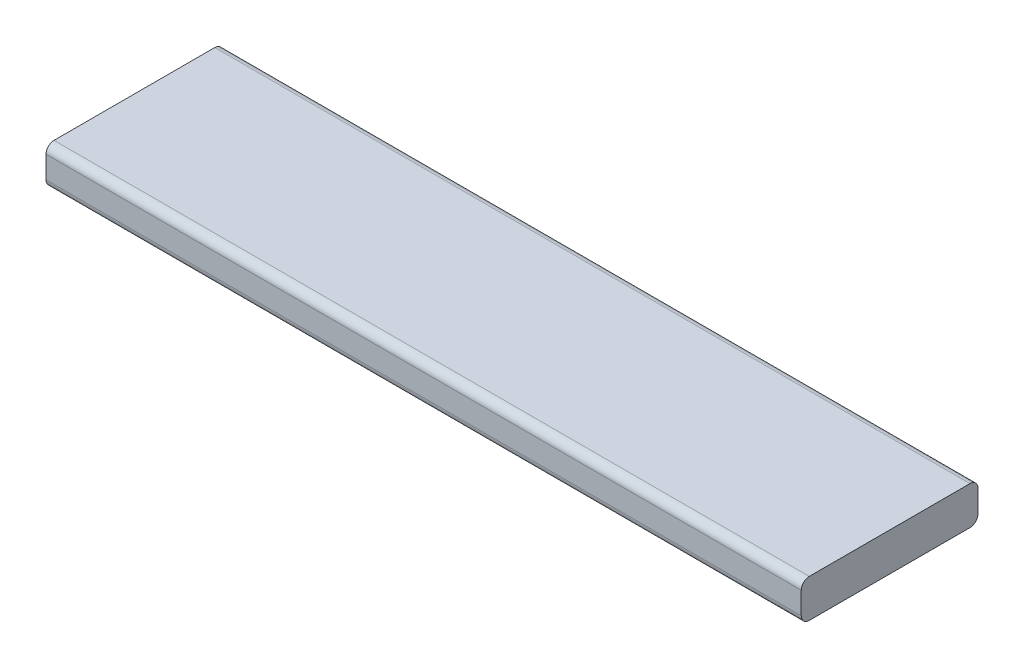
ISO-10303-21;
HEADER;
FILE_DESCRIPTION(('STEP AP214'),'2;1');
FILE_NAME('part.step','',(''),(''),'','','');
FILE_SCHEMA(('AUTOMOTIVE_DESIGN { 1 0 10303 214 1 1 1 1 }'));
ENDSEC;
DATA;
#1=APPLICATION_CONTEXT('core data for automotive mechanical design processes');
#2=APPLICATION_PROTOCOL_DEFINITION('international standard','automotive_design',2000,#1);
#3=PRODUCT_CONTEXT('',#1,'mechanical');
#4=PRODUCT('Part','Part','',(#3));
#5=PRODUCT_RELATED_PRODUCT_CATEGORY('part','',(#4));
#6=PRODUCT_DEFINITION_FORMATION('','',#4);
#7=PRODUCT_DEFINITION_CONTEXT('part definition',#1,'design');
#8=PRODUCT_DEFINITION('design','',#6,#7);
#9=PRODUCT_DEFINITION_SHAPE('','',#8);
#10=(LENGTH_UNIT() NAMED_UNIT(*) SI_UNIT(.MILLI.,.METRE.));
#11=(NAMED_UNIT(*) PLANE_ANGLE_UNIT() SI_UNIT($,.RADIAN.));
#12=(NAMED_UNIT(*) SI_UNIT($,.STERADIAN.) SOLID_ANGLE_UNIT());
#13=UNCERTAINTY_MEASURE_WITH_UNIT(LENGTH_MEASURE(1.E-05),#10,'distance_accuracy_value','');
#14=(GEOMETRIC_REPRESENTATION_CONTEXT(3) GLOBAL_UNCERTAINTY_ASSIGNED_CONTEXT((#13)) GLOBAL_UNIT_ASSIGNED_CONTEXT((#10,
#11,#12)) REPRESENTATION_CONTEXT('',''));
#15=CARTESIAN_POINT('',(0.,0.,0.));
#16=DIRECTION('',(0.,0.,1.));
#17=DIRECTION('',(1.,0.,0.));
#18=AXIS2_PLACEMENT_3D('',#15,#16,#17);
#19=CARTESIAN_POINT('',(739.819090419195,0.,0.));
#20=DIRECTION('',(0.,0.,1.));
#21=DIRECTION('',(1.,0.,0.));
#22=AXIS2_PLACEMENT_3D('',#19,#20,#21);
#23=PLANE('',#22);
#24=DIRECTION('',(0.,1.,0.));
#25=VECTOR('',#24,1.);
#26=CARTESIAN_POINT('',(0.,0.,0.));
#27=LINE('',#26,#25);
#28=CARTESIAN_POINT('',(0.,6.35,0.));
#29=VERTEX_POINT('',#28);
#30=CARTESIAN_POINT('',(0.,23.8125,0.));
#31=VERTEX_POINT('',#30);
#32=EDGE_CURVE('E175',#29,#31,#27,.T.);
#33=ORIENTED_EDGE('',*,*,#32,.T.);
#34=DIRECTION('',(-1.,0.,0.));
#35=VECTOR('',#34,1.);
#36=CARTESIAN_POINT('',(739.819090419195,23.8125,0.));
#37=LINE('',#36,#35);
#38=CARTESIAN_POINT('',(596.9,23.8125,0.));
#39=VERTEX_POINT('',#38);
#40=EDGE_CURVE('E56',#31,#39,#37,.F.);
#41=ORIENTED_EDGE('',*,*,#40,.T.);
#42=DIRECTION('',(0.,1.,0.));
#43=VECTOR('',#42,1.);
#44=CARTESIAN_POINT('',(596.9,0.,0.));
#45=LINE('',#44,#43);
#46=CARTESIAN_POINT('',(596.9,6.35,0.));
#47=VERTEX_POINT('',#46);
#48=EDGE_CURVE('E169',#47,#39,#45,.T.);
#49=ORIENTED_EDGE('',*,*,#48,.F.);
#50=DIRECTION('',(-1.,0.,0.));
#51=VECTOR('',#50,1.);
#52=CARTESIAN_POINT('',(739.819090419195,6.35,0.));
#53=LINE('',#52,#51);
#54=EDGE_CURVE('E117',#47,#29,#53,.T.);
#55=ORIENTED_EDGE('',*,*,#54,.T.);
#56=EDGE_LOOP('',(#33,#41,#49,#55));
#57=FACE_BOUND('',#56,.T.);
#58=ADVANCED_FACE('F41',(#57),#23,.F.);
#59=CARTESIAN_POINT('',(739.819090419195,30.1625,0.));
#60=DIRECTION('',(0.,-1.,0.));
#61=DIRECTION('',(0.,0.,-1.));
#62=AXIS2_PLACEMENT_3D('',#59,#60,#61);
#63=PLANE('',#62);
#64=DIRECTION('',(0.,0.,1.));
#65=VECTOR('',#64,1.);
#66=CARTESIAN_POINT('',(0.,30.1625,0.));
#67=LINE('',#66,#65);
#68=CARTESIAN_POINT('',(0.,30.1625,6.35));
#69=VERTEX_POINT('',#68);
#70=CARTESIAN_POINT('',(0.,30.1625,133.35));
#71=VERTEX_POINT('',#70);
#72=EDGE_CURVE('E170',#69,#71,#67,.T.);
#73=ORIENTED_EDGE('',*,*,#72,.T.);
#74=DIRECTION('',(-1.,0.,0.));
#75=VECTOR('',#74,1.);
#76=CARTESIAN_POINT('',(739.819090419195,30.1625,133.35));
#77=LINE('',#76,#75);
#78=CARTESIAN_POINT('',(596.9,30.1625,133.35));
#79=VERTEX_POINT('',#78);
#80=EDGE_CURVE('E145',#71,#79,#77,.F.);
#81=ORIENTED_EDGE('',*,*,#80,.T.);
#82=DIRECTION('',(0.,0.,1.));
#83=VECTOR('',#82,1.);
#84=CARTESIAN_POINT('',(596.9,30.1625,0.));
#85=LINE('',#84,#83);
#86=CARTESIAN_POINT('',(596.9,30.1625,6.35));
#87=VERTEX_POINT('',#86);
#88=EDGE_CURVE('E113',#87,#79,#85,.T.);
#89=ORIENTED_EDGE('',*,*,#88,.F.);
#90=DIRECTION('',(-1.,0.,0.));
#91=VECTOR('',#90,1.);
#92=CARTESIAN_POINT('',(739.819090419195,30.1625,6.35));
#93=LINE('',#92,#91);
#94=EDGE_CURVE('E142',#87,#69,#93,.T.);
#95=ORIENTED_EDGE('',*,*,#94,.T.);
#96=EDGE_LOOP('',(#73,#81,#89,#95));
#97=FACE_BOUND('',#96,.T.);
#98=ADVANCED_FACE('F185',(#97),#63,.F.);
#99=CARTESIAN_POINT('',(739.819090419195,0.,139.7));
#100=DIRECTION('',(0.,0.,-1.));
#101=DIRECTION('',(-1.,0.,0.));
#102=AXIS2_PLACEMENT_3D('',#99,#100,#101);
#103=PLANE('',#102);
#104=DIRECTION('',(0.,-1.,0.));
#105=VECTOR('',#104,1.);
#106=CARTESIAN_POINT('',(596.9,0.,139.7));
#107=LINE('',#106,#105);
#108=CARTESIAN_POINT('',(596.9,23.8125,139.7));
#109=VERTEX_POINT('',#108);
#110=CARTESIAN_POINT('',(596.9,6.34999999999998,139.7));
#111=VERTEX_POINT('',#110);
#112=EDGE_CURVE('E110',#109,#111,#107,.T.);
#113=ORIENTED_EDGE('',*,*,#112,.F.);
#114=DIRECTION('',(-1.,0.,0.));
#115=VECTOR('',#114,1.);
#116=CARTESIAN_POINT('',(739.819090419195,23.8125,139.7));
#117=LINE('',#116,#115);
#118=CARTESIAN_POINT('',(0.,23.8125,139.7));
#119=VERTEX_POINT('',#118);
#120=EDGE_CURVE('E124',#109,#119,#117,.T.);
#121=ORIENTED_EDGE('',*,*,#120,.T.);
#122=DIRECTION('',(0.,-1.,0.));
#123=VECTOR('',#122,1.);
#124=CARTESIAN_POINT('',(0.,0.,139.7));
#125=LINE('',#124,#123);
#126=CARTESIAN_POINT('',(0.,6.34999999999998,139.7));
#127=VERTEX_POINT('',#126);
#128=EDGE_CURVE('E167',#119,#127,#125,.T.);
#129=ORIENTED_EDGE('',*,*,#128,.T.);
#130=DIRECTION('',(-1.,0.,0.));
#131=VECTOR('',#130,1.);
#132=CARTESIAN_POINT('',(739.819090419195,6.34999999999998,139.7));
#133=LINE('',#132,#131);
#134=EDGE_CURVE('E127',#127,#111,#133,.F.);
#135=ORIENTED_EDGE('',*,*,#134,.T.);
#136=EDGE_LOOP('',(#113,#121,#129,#135));
#137=FACE_BOUND('',#136,.T.);
#138=ADVANCED_FACE('F122',(#137),#103,.F.);
#139=CARTESIAN_POINT('',(739.819090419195,0.,0.));
#140=DIRECTION('',(0.,1.,0.));
#141=DIRECTION('',(0.,0.,1.));
#142=AXIS2_PLACEMENT_3D('',#139,#140,#141);
#143=PLANE('',#142);
#144=DIRECTION('',(0.,0.,-1.));
#145=VECTOR('',#144,1.);
#146=CARTESIAN_POINT('',(0.,0.,0.));
#147=LINE('',#146,#145);
#148=CARTESIAN_POINT('',(0.,0.,133.35));
#149=VERTEX_POINT('',#148);
#150=CARTESIAN_POINT('',(0.,0.,6.35));
#151=VERTEX_POINT('',#150);
#152=EDGE_CURVE('E160',#149,#151,#147,.T.);
#153=ORIENTED_EDGE('',*,*,#152,.T.);
#154=DIRECTION('',(-1.,0.,0.));
#155=VECTOR('',#154,1.);
#156=CARTESIAN_POINT('',(739.819090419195,0.,6.35));
#157=LINE('',#156,#155);
#158=CARTESIAN_POINT('',(596.9,0.,6.35));
#159=VERTEX_POINT('',#158);
#160=EDGE_CURVE('E11',#151,#159,#157,.F.);
#161=ORIENTED_EDGE('',*,*,#160,.T.);
#162=DIRECTION('',(0.,0.,-1.));
#163=VECTOR('',#162,1.);
#164=CARTESIAN_POINT('',(596.9,0.,0.));
#165=LINE('',#164,#163);
#166=CARTESIAN_POINT('',(596.9,0.,133.35));
#167=VERTEX_POINT('',#166);
#168=EDGE_CURVE('E162',#167,#159,#165,.T.);
#169=ORIENTED_EDGE('',*,*,#168,.F.);
#170=DIRECTION('',(-1.,0.,0.));
#171=VECTOR('',#170,1.);
#172=CARTESIAN_POINT('',(739.819090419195,0.,133.35));
#173=LINE('',#172,#171);
#174=EDGE_CURVE('E49',#167,#149,#173,.T.);
#175=ORIENTED_EDGE('',*,*,#174,.T.);
#176=EDGE_LOOP('',(#153,#161,#169,#175));
#177=FACE_BOUND('',#176,.T.);
#178=ADVANCED_FACE('F159',(#177),#143,.F.);
#179=CARTESIAN_POINT('',(0.,0.,0.));
#180=DIRECTION('',(1.,0.,0.));
#181=DIRECTION('',(0.,0.,-1.));
#182=AXIS2_PLACEMENT_3D('',#179,#180,#181);
#183=PLANE('',#182);
#184=ORIENTED_EDGE('',*,*,#128,.F.);
#185=CARTESIAN_POINT('',(0.,23.8125,133.35));
#186=DIRECTION('',(1.,0.,0.));
#187=DIRECTION('',(0.,0.,-1.));
#188=AXIS2_PLACEMENT_3D('',#185,#186,#187);
#189=CIRCLE('',#188,6.35);
#190=EDGE_CURVE('E130',#119,#71,#189,.F.);
#191=ORIENTED_EDGE('',*,*,#190,.T.);
#192=ORIENTED_EDGE('',*,*,#72,.F.);
#193=CARTESIAN_POINT('',(0.,23.8125,6.35));
#194=DIRECTION('',(1.,0.,0.));
#195=DIRECTION('',(0.,0.,-1.));
#196=AXIS2_PLACEMENT_3D('',#193,#194,#195);
#197=CIRCLE('',#196,6.35);
#198=EDGE_CURVE('E139',#69,#31,#197,.F.);
#199=ORIENTED_EDGE('',*,*,#198,.T.);
#200=ORIENTED_EDGE('',*,*,#32,.F.);
#201=CARTESIAN_POINT('',(0.,6.35,6.35));
#202=DIRECTION('',(1.,0.,0.));
#203=DIRECTION('',(0.,0.,-1.));
#204=AXIS2_PLACEMENT_3D('',#201,#202,#203);
#205=CIRCLE('',#204,6.35);
#206=EDGE_CURVE('E133',#29,#151,#205,.F.);
#207=ORIENTED_EDGE('',*,*,#206,.T.);
#208=ORIENTED_EDGE('',*,*,#152,.F.);
#209=CARTESIAN_POINT('',(0.,6.34999999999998,133.35));
#210=DIRECTION('',(1.,0.,0.));
#211=DIRECTION('',(0.,0.,-1.));
#212=AXIS2_PLACEMENT_3D('',#209,#210,#211);
#213=CIRCLE('',#212,6.35);
#214=EDGE_CURVE('E131',#149,#127,#213,.F.);
#215=ORIENTED_EDGE('',*,*,#214,.T.);
#216=EDGE_LOOP('',(#184,#191,#192,#199,#200,#207,#208,#215));
#217=FACE_BOUND('',#216,.T.);
#218=ADVANCED_FACE('F165',(#217),#183,.F.);
#219=CARTESIAN_POINT('',(596.9,0.,0.));
#220=DIRECTION('',(1.,0.,0.));
#221=DIRECTION('',(0.,0.,-1.));
#222=AXIS2_PLACEMENT_3D('',#219,#220,#221);
#223=PLANE('',#222);
#224=ORIENTED_EDGE('',*,*,#88,.T.);
#225=CARTESIAN_POINT('',(596.9,23.8125,133.35));
#226=DIRECTION('',(1.,0.,0.));
#227=DIRECTION('',(0.,0.,-1.));
#228=AXIS2_PLACEMENT_3D('',#225,#226,#227);
#229=CIRCLE('',#228,6.35);
#230=EDGE_CURVE('E107',#79,#109,#229,.T.);
#231=ORIENTED_EDGE('',*,*,#230,.T.);
#232=ORIENTED_EDGE('',*,*,#112,.T.);
#233=CARTESIAN_POINT('',(596.9,6.34999999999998,133.35));
#234=DIRECTION('',(1.,0.,0.));
#235=DIRECTION('',(0.,0.,-1.));
#236=AXIS2_PLACEMENT_3D('',#233,#234,#235);
#237=CIRCLE('',#236,6.35);
#238=EDGE_CURVE('E147',#111,#167,#237,.T.);
#239=ORIENTED_EDGE('',*,*,#238,.T.);
#240=ORIENTED_EDGE('',*,*,#168,.T.);
#241=CARTESIAN_POINT('',(596.9,6.35,6.35));
#242=DIRECTION('',(1.,0.,0.));
#243=DIRECTION('',(0.,0.,-1.));
#244=AXIS2_PLACEMENT_3D('',#241,#242,#243);
#245=CIRCLE('',#244,6.35);
#246=EDGE_CURVE('E63',#159,#47,#245,.T.);
#247=ORIENTED_EDGE('',*,*,#246,.T.);
#248=ORIENTED_EDGE('',*,*,#48,.T.);
#249=CARTESIAN_POINT('',(596.9,23.8125,6.35));
#250=DIRECTION('',(1.,0.,0.));
#251=DIRECTION('',(0.,0.,-1.));
#252=AXIS2_PLACEMENT_3D('',#249,#250,#251);
#253=CIRCLE('',#252,6.35);
#254=EDGE_CURVE('E118',#39,#87,#253,.T.);
#255=ORIENTED_EDGE('',*,*,#254,.T.);
#256=EDGE_LOOP('',(#224,#231,#232,#239,#240,#247,#248,#255));
#257=FACE_BOUND('',#256,.T.);
#258=ADVANCED_FACE('F109',(#257),#223,.T.);
#259=CARTESIAN_POINT('',(739.819090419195,23.8125,133.35));
#260=DIRECTION('',(-1.,0.,0.));
#261=DIRECTION('',(0.,0.,1.));
#262=AXIS2_PLACEMENT_3D('',#259,#260,#261);
#263=CYLINDRICAL_SURFACE('',#262,6.35);
#264=ORIENTED_EDGE('',*,*,#230,.F.);
#265=ORIENTED_EDGE('',*,*,#80,.F.);
#266=ORIENTED_EDGE('',*,*,#190,.F.);
#267=ORIENTED_EDGE('',*,*,#120,.F.);
#268=EDGE_LOOP('',(#264,#265,#266,#267));
#269=FACE_BOUND('',#268,.T.);
#270=ADVANCED_FACE('F129',(#269),#263,.T.);
#271=CARTESIAN_POINT('',(739.819090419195,23.8125,6.35));
#272=DIRECTION('',(-1.,0.,0.));
#273=DIRECTION('',(0.,0.,1.));
#274=AXIS2_PLACEMENT_3D('',#271,#272,#273);
#275=CYLINDRICAL_SURFACE('',#274,6.35);
#276=ORIENTED_EDGE('',*,*,#254,.F.);
#277=ORIENTED_EDGE('',*,*,#40,.F.);
#278=ORIENTED_EDGE('',*,*,#198,.F.);
#279=ORIENTED_EDGE('',*,*,#94,.F.);
#280=EDGE_LOOP('',(#276,#277,#278,#279));
#281=FACE_BOUND('',#280,.T.);
#282=ADVANCED_FACE('F182',(#281),#275,.T.);
#283=CARTESIAN_POINT('',(739.819090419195,6.35,6.35));
#284=DIRECTION('',(-1.,0.,0.));
#285=DIRECTION('',(0.,0.,1.));
#286=AXIS2_PLACEMENT_3D('',#283,#284,#285);
#287=CYLINDRICAL_SURFACE('',#286,6.35);
#288=ORIENTED_EDGE('',*,*,#246,.F.);
#289=ORIENTED_EDGE('',*,*,#160,.F.);
#290=ORIENTED_EDGE('',*,*,#206,.F.);
#291=ORIENTED_EDGE('',*,*,#54,.F.);
#292=EDGE_LOOP('',(#288,#289,#290,#291));
#293=FACE_BOUND('',#292,.T.);
#294=ADVANCED_FACE('F187',(#293),#287,.T.);
#295=CARTESIAN_POINT('',(739.819090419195,6.34999999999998,133.35));
#296=DIRECTION('',(-1.,0.,0.));
#297=DIRECTION('',(0.,0.,1.));
#298=AXIS2_PLACEMENT_3D('',#295,#296,#297);
#299=CYLINDRICAL_SURFACE('',#298,6.35);
#300=ORIENTED_EDGE('',*,*,#238,.F.);
#301=ORIENTED_EDGE('',*,*,#134,.F.);
#302=ORIENTED_EDGE('',*,*,#214,.F.);
#303=ORIENTED_EDGE('',*,*,#174,.F.);
#304=EDGE_LOOP('',(#300,#301,#302,#303));
#305=FACE_BOUND('',#304,.T.);
#306=ADVANCED_FACE('F43',(#305),#299,.T.);
#307=CLOSED_SHELL('',(#58,#98,#138,#178,#218,#258,#270,#282,#294,#306));
#308=MANIFOLD_SOLID_BREP('B2',#307);
#309=ADVANCED_BREP_SHAPE_REPRESENTATION('',(#18,#308),#14);
#310=SHAPE_DEFINITION_REPRESENTATION(#9,#309);
ENDSEC;
END-ISO-10303-21;
